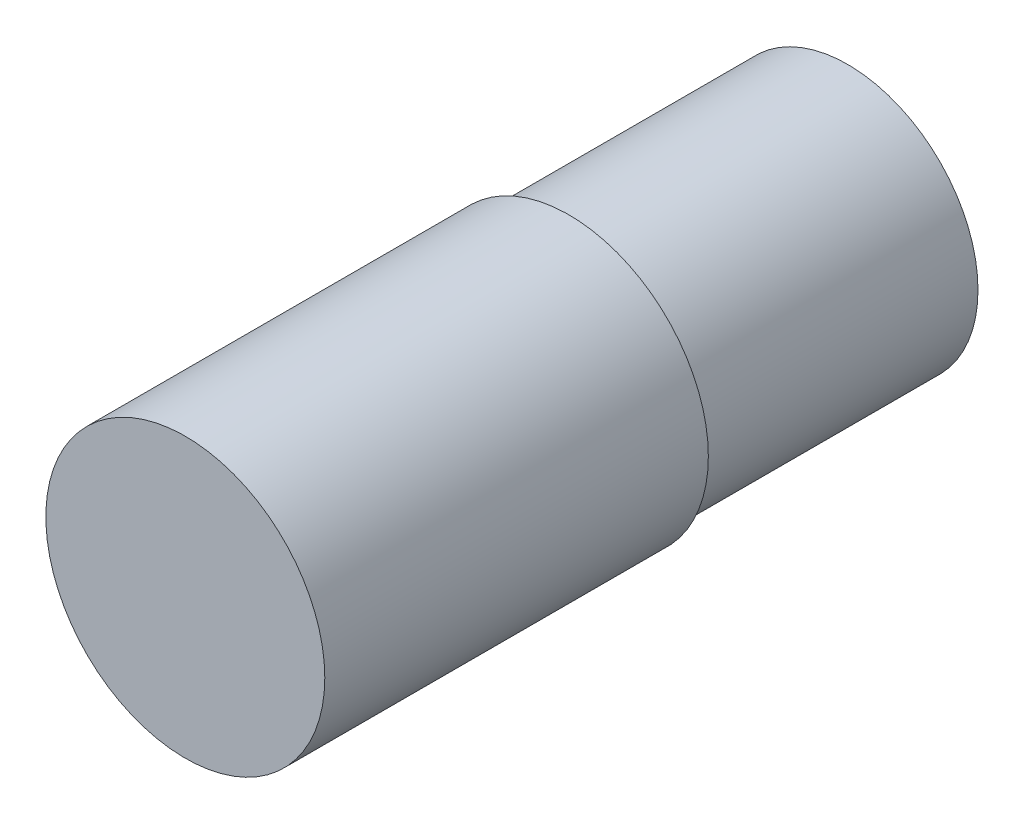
from build123d import *

# Parameters (mm, degrees)
ESQUISSE1_R      = 28
EXTRUSION1_DEPTH = 60
ESQUISSE2_R      = 30
EXTRUSION2_DEPTH = 82.5


with BuildPart() as part:
    # Esquisse1 → Extrusion1 (new body)
    with BuildSketch(Plane.XY):
        Circle(ESQUISSE1_R)
    extrude(amount=EXTRUSION1_DEPTH)

    # Esquisse2 → Extrusion2 (add)
    with BuildSketch(Plane.XY.offset(60)):
        Circle(ESQUISSE2_R)
    extrude(amount=EXTRUSION2_DEPTH)


solid = part.part
